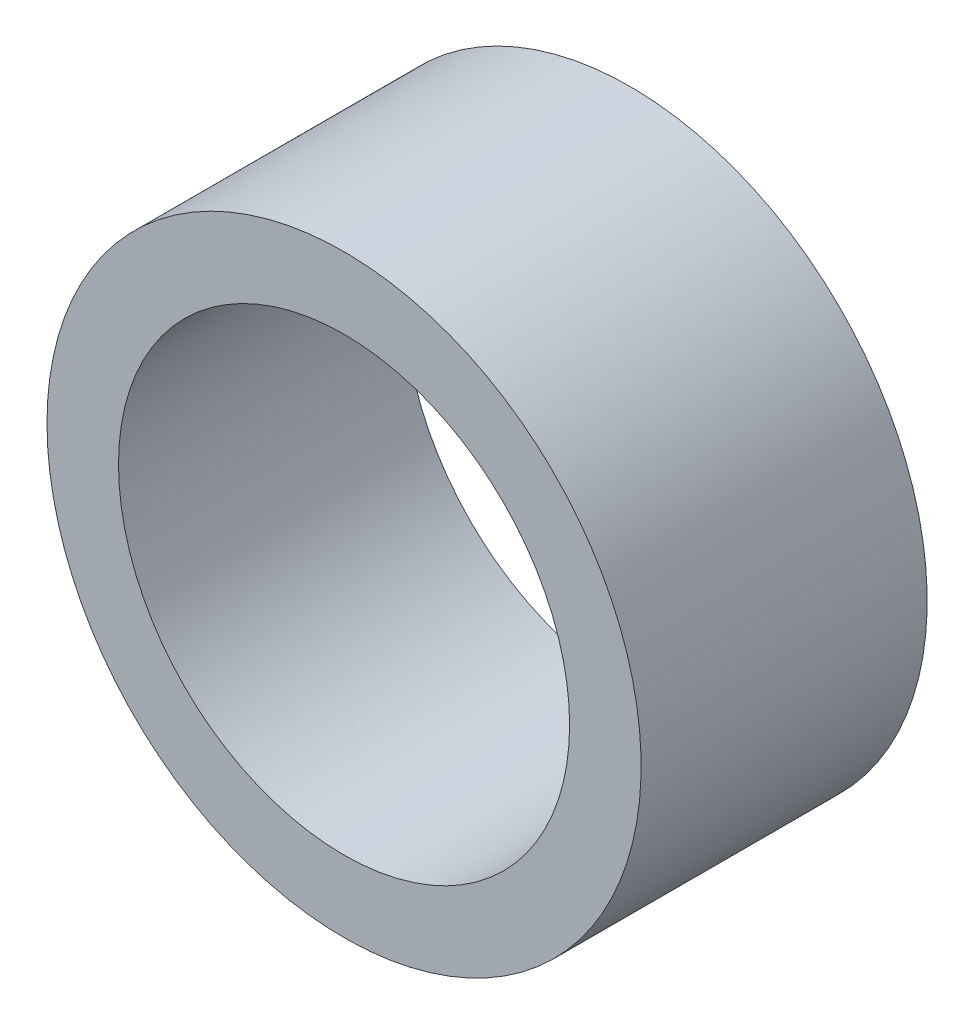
from build123d import *

# Parameters (mm, degrees)
ESQUISSE1_R          = 13.5
ESQUISSE1_R_2        = 10.25
BASE_EXTRUSION_DEPTH = 13


with BuildPart() as part:
    # Esquisse1 → Base-Extrusion (new body)
    with BuildSketch(Plane.XY):
        with Locations(Location((0, 0, 0), (0, 0, 180))):
            Circle(ESQUISSE1_R)
        with Locations(Location((0, 0, 0), (0, 0, 180))):
            Circle(ESQUISSE1_R_2, mode=Mode.SUBTRACT)
    extrude(amount=BASE_EXTRUSION_DEPTH)


solid = part.part
